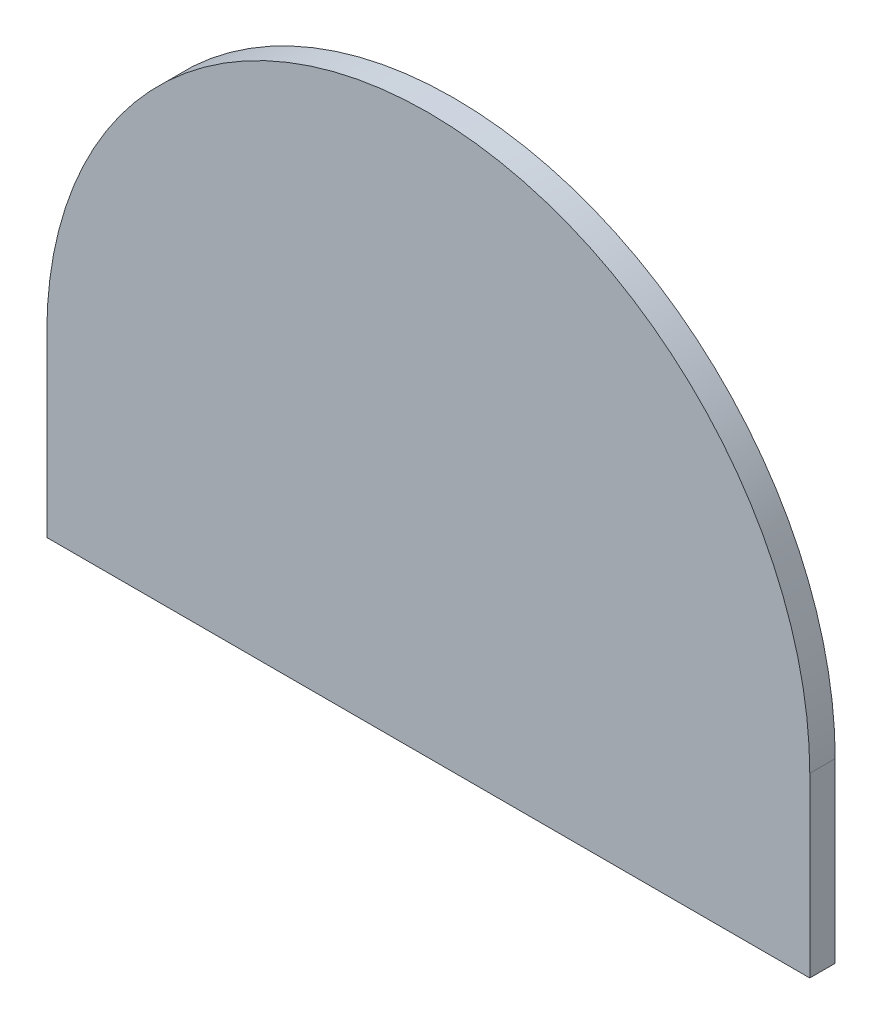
ISO-10303-21;
HEADER;
FILE_DESCRIPTION(('STEP AP214'),'2;1');
FILE_NAME('part.step','',(''),(''),'','','');
FILE_SCHEMA(('AUTOMOTIVE_DESIGN { 1 0 10303 214 1 1 1 1 }'));
ENDSEC;
DATA;
#1=APPLICATION_CONTEXT('core data for automotive mechanical design processes');
#2=APPLICATION_PROTOCOL_DEFINITION('international standard','automotive_design',2000,#1);
#3=PRODUCT_CONTEXT('',#1,'mechanical');
#4=PRODUCT('Part','Part','',(#3));
#5=PRODUCT_RELATED_PRODUCT_CATEGORY('part','',(#4));
#6=PRODUCT_DEFINITION_FORMATION('','',#4);
#7=PRODUCT_DEFINITION_CONTEXT('part definition',#1,'design');
#8=PRODUCT_DEFINITION('design','',#6,#7);
#9=PRODUCT_DEFINITION_SHAPE('','',#8);
#10=(LENGTH_UNIT() NAMED_UNIT(*) SI_UNIT(.MILLI.,.METRE.));
#11=(NAMED_UNIT(*) PLANE_ANGLE_UNIT() SI_UNIT($,.RADIAN.));
#12=(NAMED_UNIT(*) SI_UNIT($,.STERADIAN.) SOLID_ANGLE_UNIT());
#13=UNCERTAINTY_MEASURE_WITH_UNIT(LENGTH_MEASURE(1.E-05),#10,'distance_accuracy_value','');
#14=(GEOMETRIC_REPRESENTATION_CONTEXT(3) GLOBAL_UNCERTAINTY_ASSIGNED_CONTEXT((#13)) GLOBAL_UNIT_ASSIGNED_CONTEXT((#10,
#11,#12)) REPRESENTATION_CONTEXT('',''));
#15=CARTESIAN_POINT('',(0.,0.,0.));
#16=DIRECTION('',(0.,0.,1.));
#17=DIRECTION('',(1.,0.,0.));
#18=AXIS2_PLACEMENT_3D('',#15,#16,#17);
#19=CARTESIAN_POINT('',(0.,-39.2497107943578,15.));
#20=DIRECTION('',(0.,1.,0.));
#21=DIRECTION('',(-1.,0.,0.));
#22=AXIS2_PLACEMENT_3D('',#19,#20,#21);
#23=PLANE('',#22);
#24=DIRECTION('',(1.,0.,0.));
#25=VECTOR('',#24,1.);
#26=CARTESIAN_POINT('',(0.,-39.2497107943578,0.));
#27=LINE('',#26,#25);
#28=CARTESIAN_POINT('',(-47.8587471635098,-39.2497107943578,0.));
#29=VERTEX_POINT('',#28);
#30=CARTESIAN_POINT('',(402.14125283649,-39.2497107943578,0.));
#31=VERTEX_POINT('',#30);
#32=EDGE_CURVE('E98',#29,#31,#27,.T.);
#33=ORIENTED_EDGE('',*,*,#32,.T.);
#34=DIRECTION('',(0.,0.,-1.));
#35=VECTOR('',#34,1.);
#36=CARTESIAN_POINT('',(402.14125283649,-39.2497107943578,15.));
#37=LINE('',#36,#35);
#38=CARTESIAN_POINT('',(402.14125283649,-39.2497107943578,15.));
#39=VERTEX_POINT('',#38);
#40=EDGE_CURVE('E11',#39,#31,#37,.T.);
#41=ORIENTED_EDGE('',*,*,#40,.F.);
#42=DIRECTION('',(1.,0.,0.));
#43=VECTOR('',#42,1.);
#44=CARTESIAN_POINT('',(0.,-39.2497107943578,15.));
#45=LINE('',#44,#43);
#46=CARTESIAN_POINT('',(-47.8587471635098,-39.2497107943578,15.));
#47=VERTEX_POINT('',#46);
#48=EDGE_CURVE('E77',#47,#39,#45,.T.);
#49=ORIENTED_EDGE('',*,*,#48,.F.);
#50=DIRECTION('',(0.,0.,-1.));
#51=VECTOR('',#50,1.);
#52=CARTESIAN_POINT('',(-47.8587471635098,-39.2497107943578,15.));
#53=LINE('',#52,#51);
#54=EDGE_CURVE('E97',#47,#29,#53,.T.);
#55=ORIENTED_EDGE('',*,*,#54,.T.);
#56=EDGE_LOOP('',(#33,#41,#49,#55));
#57=FACE_BOUND('',#56,.T.);
#58=ADVANCED_FACE('F35',(#57),#23,.F.);
#59=CARTESIAN_POINT('',(402.14125283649,-2.13497741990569E-13,15.));
#60=DIRECTION('',(1.,0.,0.));
#61=DIRECTION('',(0.,1.,0.));
#62=AXIS2_PLACEMENT_3D('',#59,#60,#61);
#63=PLANE('',#62);
#64=DIRECTION('',(0.,-1.,0.));
#65=VECTOR('',#64,1.);
#66=CARTESIAN_POINT('',(402.14125283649,-2.13497741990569E-13,0.));
#67=LINE('',#66,#65);
#68=CARTESIAN_POINT('',(402.14125283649,65.3102892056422,0.));
#69=VERTEX_POINT('',#68);
#70=EDGE_CURVE('E87',#69,#31,#67,.T.);
#71=ORIENTED_EDGE('',*,*,#70,.F.);
#72=DIRECTION('',(0.,0.,-1.));
#73=VECTOR('',#72,1.);
#74=CARTESIAN_POINT('',(402.14125283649,65.3102892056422,15.));
#75=LINE('',#74,#73);
#76=CARTESIAN_POINT('',(402.14125283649,65.3102892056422,15.));
#77=VERTEX_POINT('',#76);
#78=EDGE_CURVE('E43',#77,#69,#75,.T.);
#79=ORIENTED_EDGE('',*,*,#78,.F.);
#80=DIRECTION('',(0.,-1.,0.));
#81=VECTOR('',#80,1.);
#82=CARTESIAN_POINT('',(402.14125283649,-2.13497741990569E-13,15.));
#83=LINE('',#82,#81);
#84=EDGE_CURVE('E85',#77,#39,#83,.T.);
#85=ORIENTED_EDGE('',*,*,#84,.T.);
#86=ORIENTED_EDGE('',*,*,#40,.T.);
#87=EDGE_LOOP('',(#71,#79,#85,#86));
#88=FACE_BOUND('',#87,.T.);
#89=ADVANCED_FACE('F84',(#88),#63,.T.);
#90=CARTESIAN_POINT('',(177.14125283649,65.3102892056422,15.));
#91=DIRECTION('',(0.,0.,-1.));
#92=DIRECTION('',(-1.,0.,0.));
#93=AXIS2_PLACEMENT_3D('',#90,#91,#92);
#94=CYLINDRICAL_SURFACE('',#93,225.);
#95=CARTESIAN_POINT('',(177.14125283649,65.3102892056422,0.));
#96=DIRECTION('',(0.,0.,1.));
#97=DIRECTION('',(1.,0.,0.));
#98=AXIS2_PLACEMENT_3D('',#95,#96,#97);
#99=CIRCLE('',#98,225.);
#100=CARTESIAN_POINT('',(-47.8587471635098,65.3102892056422,0.));
#101=VERTEX_POINT('',#100);
#102=EDGE_CURVE('E66',#69,#101,#99,.T.);
#103=ORIENTED_EDGE('',*,*,#102,.T.);
#104=DIRECTION('',(0.,0.,-1.));
#105=VECTOR('',#104,1.);
#106=CARTESIAN_POINT('',(-47.8587471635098,65.3102892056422,15.));
#107=LINE('',#106,#105);
#108=CARTESIAN_POINT('',(-47.8587471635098,65.3102892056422,15.));
#109=VERTEX_POINT('',#108);
#110=EDGE_CURVE('E88',#109,#101,#107,.T.);
#111=ORIENTED_EDGE('',*,*,#110,.F.);
#112=CARTESIAN_POINT('',(177.14125283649,65.3102892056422,15.));
#113=DIRECTION('',(0.,0.,1.));
#114=DIRECTION('',(1.,0.,0.));
#115=AXIS2_PLACEMENT_3D('',#112,#113,#114);
#116=CIRCLE('',#115,225.);
#117=EDGE_CURVE('E89',#77,#109,#116,.T.);
#118=ORIENTED_EDGE('',*,*,#117,.F.);
#119=ORIENTED_EDGE('',*,*,#78,.T.);
#120=EDGE_LOOP('',(#103,#111,#118,#119));
#121=FACE_BOUND('',#120,.T.);
#122=ADVANCED_FACE('F90',(#121),#94,.T.);
#123=CARTESIAN_POINT('',(-47.8587471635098,0.,15.));
#124=DIRECTION('',(1.,0.,0.));
#125=DIRECTION('',(0.,1.,0.));
#126=AXIS2_PLACEMENT_3D('',#123,#124,#125);
#127=PLANE('',#126);
#128=DIRECTION('',(0.,-1.,0.));
#129=VECTOR('',#128,1.);
#130=CARTESIAN_POINT('',(-47.8587471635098,0.,0.));
#131=LINE('',#130,#129);
#132=EDGE_CURVE('E72',#101,#29,#131,.T.);
#133=ORIENTED_EDGE('',*,*,#132,.T.);
#134=ORIENTED_EDGE('',*,*,#54,.F.);
#135=DIRECTION('',(0.,-1.,0.));
#136=VECTOR('',#135,1.);
#137=CARTESIAN_POINT('',(-47.8587471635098,0.,15.));
#138=LINE('',#137,#136);
#139=EDGE_CURVE('E51',#109,#47,#138,.T.);
#140=ORIENTED_EDGE('',*,*,#139,.F.);
#141=ORIENTED_EDGE('',*,*,#110,.T.);
#142=EDGE_LOOP('',(#133,#134,#140,#141));
#143=FACE_BOUND('',#142,.T.);
#144=ADVANCED_FACE('F105',(#143),#127,.F.);
#145=CARTESIAN_POINT('',(0.,0.,15.));
#146=DIRECTION('',(0.,0.,1.));
#147=DIRECTION('',(1.,0.,0.));
#148=AXIS2_PLACEMENT_3D('',#145,#146,#147);
#149=PLANE('',#148);
#150=ORIENTED_EDGE('',*,*,#48,.T.);
#151=ORIENTED_EDGE('',*,*,#84,.F.);
#152=ORIENTED_EDGE('',*,*,#117,.T.);
#153=ORIENTED_EDGE('',*,*,#139,.T.);
#154=EDGE_LOOP('',(#150,#151,#152,#153));
#155=FACE_BOUND('',#154,.T.);
#156=ADVANCED_FACE('F92',(#155),#149,.T.);
#157=CARTESIAN_POINT('',(0.,0.,0.));
#158=DIRECTION('',(0.,0.,1.));
#159=DIRECTION('',(1.,0.,0.));
#160=AXIS2_PLACEMENT_3D('',#157,#158,#159);
#161=PLANE('',#160);
#162=ORIENTED_EDGE('',*,*,#32,.F.);
#163=ORIENTED_EDGE('',*,*,#132,.F.);
#164=ORIENTED_EDGE('',*,*,#102,.F.);
#165=ORIENTED_EDGE('',*,*,#70,.T.);
#166=EDGE_LOOP('',(#162,#163,#164,#165));
#167=FACE_BOUND('',#166,.T.);
#168=ADVANCED_FACE('F108',(#167),#161,.F.);
#169=CLOSED_SHELL('',(#58,#89,#122,#144,#156,#168));
#170=MANIFOLD_SOLID_BREP('B2',#169);
#171=ADVANCED_BREP_SHAPE_REPRESENTATION('',(#18,#170),#14);
#172=SHAPE_DEFINITION_REPRESENTATION(#9,#171);
ENDSEC;
END-ISO-10303-21;
